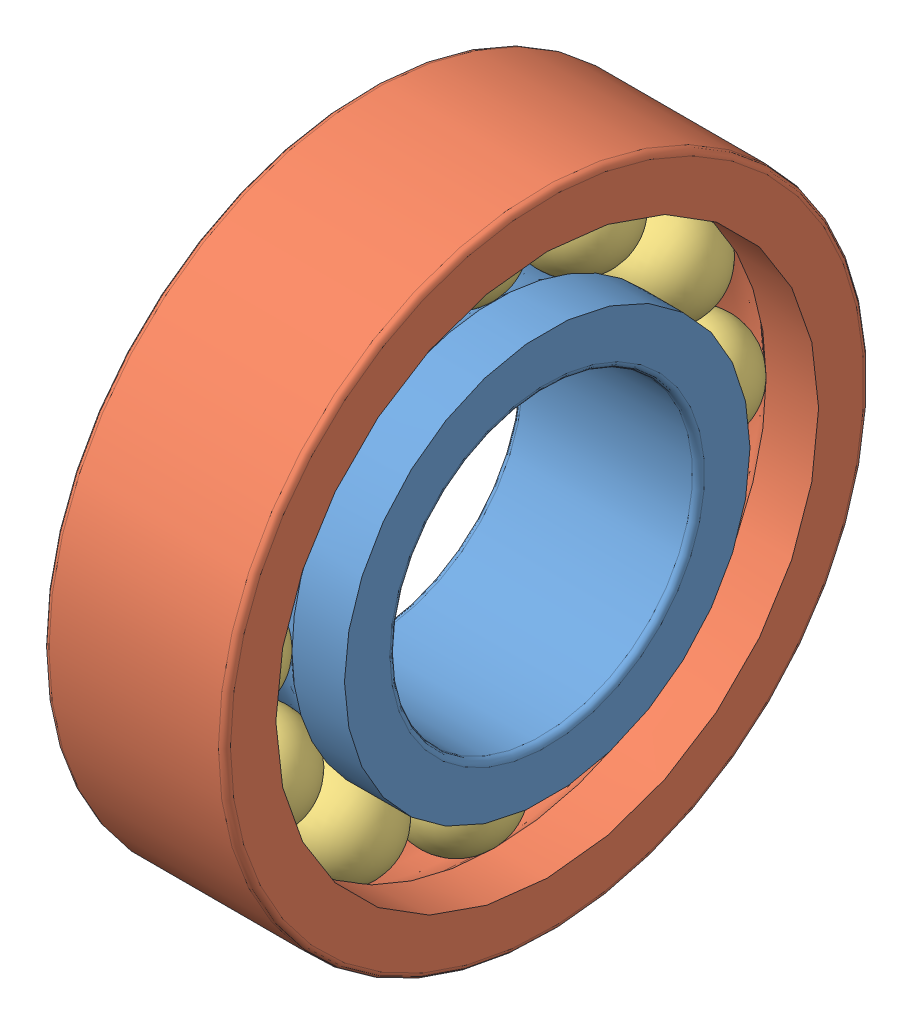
SolidWorks assembly Roulement arbre.SLDASM, configuration Défaut (file format 7000). Lengths in mm.
Overall size (9 32 32).
14 component instances, 3 part files, 4 mates.
Components (placement in the parent):
- Roulement_r1rb_Bint33-1: Roulement_r1rb_Bint33.SLDPRT [Défaut] at origin size (9 20.1 20.1)
- Roulement_r1rb_Bext33-1: Roulement_r1rb_Bext33.SLDPRT [Défaut] at origin size (9 32 32)
- Roulement_r1rb_Eroul33-1: Roulement_r1rb_Eroul33.SLDPRT [Défaut] at (0.3 0 -7.8) size (5.1 5.1 5.1)
- Roulement_r1rb_Eroul33-2: Roulement_r1rb_Eroul33.SLDPRT [Défaut] at (0.3 3.9 -6.755) x (1 0 0) z (0 -0.5 0.866025) size (5.1 5.1 5.1)
- Roulement_r1rb_Eroul33-3: Roulement_r1rb_Eroul33.SLDPRT [Défaut] at (0.3 6.755 -3.9) x (1 0 0) z (0 -0.866025 0.5) size (5.1 5.1 5.1)
- Roulement_r1rb_Eroul33-4: Roulement_r1rb_Eroul33.SLDPRT [Défaut] at (0.3 7.8 0) x (1 0 0) z (0 -1 0) size (5.1 5.1 5.1)
- Roulement_r1rb_Eroul33-5: Roulement_r1rb_Eroul33.SLDPRT [Défaut] at (0.3 6.755 3.9) x (1 0 0) z (0 -0.866025 -0.5) size (5.1 5.1 5.1)
- Roulement_r1rb_Eroul33-6: Roulement_r1rb_Eroul33.SLDPRT [Défaut] at (0.3 3.9 6.755) x (1 0 0) z (0 -0.5 -0.866025) size (5.1 5.1 5.1)
- Roulement_r1rb_Eroul33-7: Roulement_r1rb_Eroul33.SLDPRT [Défaut] at (0.3 0 7.8) x (1 0 0) z (0 0 -1) size (5.1 5.1 5.1)
- Roulement_r1rb_Eroul33-8: Roulement_r1rb_Eroul33.SLDPRT [Défaut] at (0.3 -3.9 6.755) x (1 0 0) z (0 0.5 -0.866025) size (5.1 5.1 5.1)
- Roulement_r1rb_Eroul33-9: Roulement_r1rb_Eroul33.SLDPRT [Défaut] at (0.3 -6.755 3.9) x (1 0 0) z (0 0.866025 -0.5) size (5.1 5.1 5.1)
- Roulement_r1rb_Eroul33-10: Roulement_r1rb_Eroul33.SLDPRT [Défaut] at (0.3 -7.8 0) x (1 0 0) z (0 1 0) size (5.1 5.1 5.1)
- Roulement_r1rb_Eroul33-11: Roulement_r1rb_Eroul33.SLDPRT [Défaut] at (0.3 -6.755 -3.9) x (1 0 0) z (0 0.866025 0.5) size (5.1 5.1 5.1)
- Roulement_r1rb_Eroul33-12: Roulement_r1rb_Eroul33.SLDPRT [Défaut] at (0.3 -3.9 -6.755) x (1 0 0) z (0 0.5 0.866025) size (5.1 5.1 5.1)
Mates (geometry in assembly coordinates):
- Coïncidente1: coincident: point of ?
- Coïncidente2: coincident: unknown of ?
- Coïncidente4: coincident: point of Roulement_r1rb_Eroul33-1; point of assembly
- Parallèle1: parallel aligned: plane of Roulement_r1rb_Bint33-1 through (0 0 0) normal (1 0 0); plane of Roulement_r1rb_Bext33-1 through (0 0 0) normal (1 0 0)
